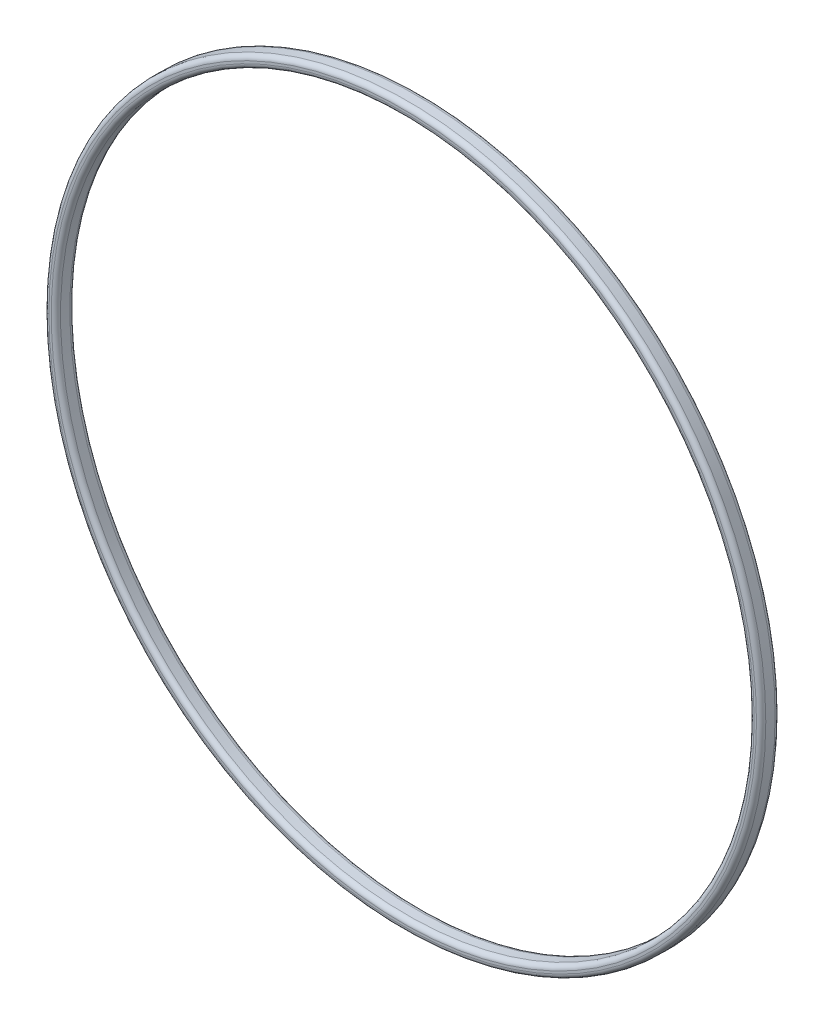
from build123d import *


with BuildPart() as part:
    # Esquisse1 → R_volution1 (revolve)
    with BuildSketch(Plane(origin=(0, 0, 0), x_dir=(0, 0, -1), z_dir=(1, 0, 0)), mode=Mode.PRIVATE) as r_volution1_sk:
        with BuildLine():
            Line((1.459361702, 77), (3.459361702, 77))
            ThreePointArc((3.459361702, 77), (4.166468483, 76.707106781), (4.459361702, 76))
            Line((4.459361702, 76), (4.459361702, 75.5))
            ThreePointArc((4.459361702, 75.5), (4.166468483, 74.792893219), (3.459361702, 74.5))
            Line((3.459361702, 74.5), (1.459361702, 74.5))
            ThreePointArc((1.459361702, 74.5), (0.752254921, 74.792893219), (0.459361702, 75.5))
            Line((0.459361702, 75.5), (0.459361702, 76))
            ThreePointArc((0.459361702, 76), (0.752254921, 76.707106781), (1.459361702, 77))
        make_face()
    revolve(r_volution1_sk.sketch.rotate(Axis((0, 0, 20.824397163), (0, 0, -1)), 90), axis=Axis((0, 0, 20.824397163), (0, 0, -1)))


solid = part.part
